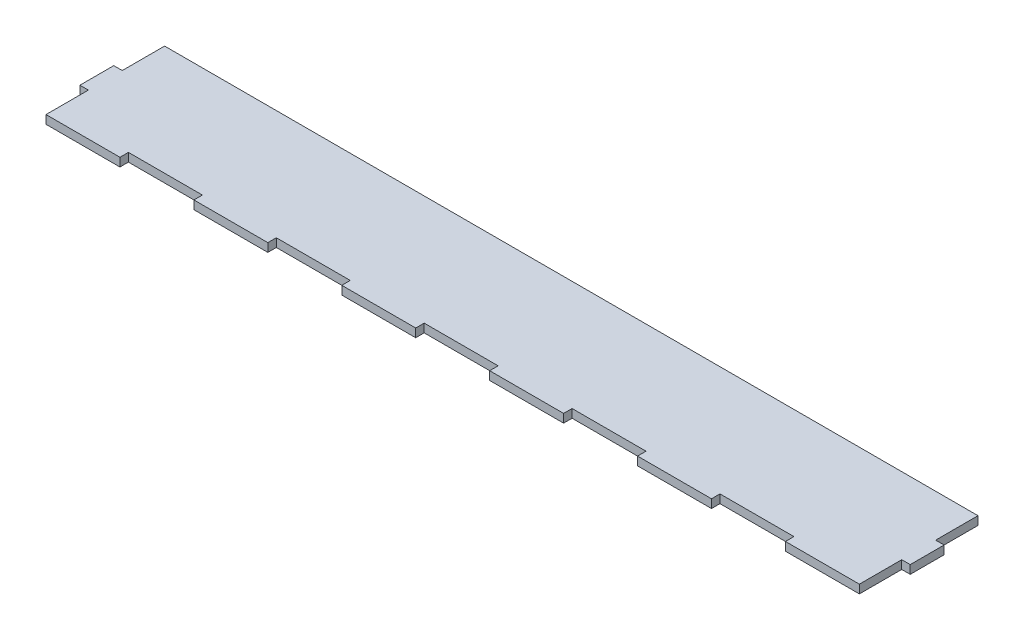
ISO-10303-21;
HEADER;
FILE_DESCRIPTION(('STEP AP214'),'2;1');
FILE_NAME('part.step','',(''),(''),'','','');
FILE_SCHEMA(('AUTOMOTIVE_DESIGN { 1 0 10303 214 1 1 1 1 }'));
ENDSEC;
DATA;
#1=APPLICATION_CONTEXT('core data for automotive mechanical design processes');
#2=APPLICATION_PROTOCOL_DEFINITION('international standard','automotive_design',2000,#1);
#3=PRODUCT_CONTEXT('',#1,'mechanical');
#4=PRODUCT('Part','Part','',(#3));
#5=PRODUCT_RELATED_PRODUCT_CATEGORY('part','',(#4));
#6=PRODUCT_DEFINITION_FORMATION('','',#4);
#7=PRODUCT_DEFINITION_CONTEXT('part definition',#1,'design');
#8=PRODUCT_DEFINITION('design','',#6,#7);
#9=PRODUCT_DEFINITION_SHAPE('','',#8);
#10=(LENGTH_UNIT() NAMED_UNIT(*) SI_UNIT(.MILLI.,.METRE.));
#11=(NAMED_UNIT(*) PLANE_ANGLE_UNIT() SI_UNIT($,.RADIAN.));
#12=(NAMED_UNIT(*) SI_UNIT($,.STERADIAN.) SOLID_ANGLE_UNIT());
#13=UNCERTAINTY_MEASURE_WITH_UNIT(LENGTH_MEASURE(1.E-05),#10,'distance_accuracy_value','');
#14=(GEOMETRIC_REPRESENTATION_CONTEXT(3) GLOBAL_UNCERTAINTY_ASSIGNED_CONTEXT((#13)) GLOBAL_UNIT_ASSIGNED_CONTEXT((#10,
#11,#12)) REPRESENTATION_CONTEXT('',''));
#15=CARTESIAN_POINT('',(0.,0.,0.));
#16=DIRECTION('',(0.,0.,1.));
#17=DIRECTION('',(1.,0.,0.));
#18=AXIS2_PLACEMENT_3D('',#15,#16,#17);
#19=CARTESIAN_POINT('',(152.4,3.175,-41.275));
#20=DIRECTION('',(0.,0.,1.));
#21=DIRECTION('',(1.,0.,0.));
#22=AXIS2_PLACEMENT_3D('',#19,#20,#21);
#23=PLANE('',#22);
#24=DIRECTION('',(-1.,0.,0.));
#25=VECTOR('',#24,1.);
#26=CARTESIAN_POINT('',(152.4,0.,-41.275));
#27=LINE('',#26,#25);
#28=CARTESIAN_POINT('',(152.4,0.,-41.275));
#29=VERTEX_POINT('',#28);
#30=CARTESIAN_POINT('',(-152.4,0.,-41.275));
#31=VERTEX_POINT('',#30);
#32=EDGE_CURVE('E521',#29,#31,#27,.T.);
#33=ORIENTED_EDGE('',*,*,#32,.T.);
#34=DIRECTION('',(0.,-1.,0.));
#35=VECTOR('',#34,1.);
#36=CARTESIAN_POINT('',(-152.4,3.175,-41.275));
#37=LINE('',#36,#35);
#38=CARTESIAN_POINT('',(-152.4,3.175,-41.275));
#39=VERTEX_POINT('',#38);
#40=EDGE_CURVE('E12',#39,#31,#37,.T.);
#41=ORIENTED_EDGE('',*,*,#40,.F.);
#42=DIRECTION('',(-1.,0.,0.));
#43=VECTOR('',#42,1.);
#44=CARTESIAN_POINT('',(152.4,3.175,-41.275));
#45=LINE('',#44,#43);
#46=CARTESIAN_POINT('',(152.4,3.175,-41.275));
#47=VERTEX_POINT('',#46);
#48=EDGE_CURVE('E414',#47,#39,#45,.T.);
#49=ORIENTED_EDGE('',*,*,#48,.F.);
#50=DIRECTION('',(0.,-1.,0.));
#51=VECTOR('',#50,1.);
#52=CARTESIAN_POINT('',(152.4,3.175,-41.275));
#53=LINE('',#52,#51);
#54=EDGE_CURVE('E275',#47,#29,#53,.T.);
#55=ORIENTED_EDGE('',*,*,#54,.T.);
#56=EDGE_LOOP('',(#33,#41,#49,#55));
#57=FACE_BOUND('',#56,.T.);
#58=ADVANCED_FACE('F36',(#57),#23,.F.);
#59=CARTESIAN_POINT('',(-152.4,3.175,-41.275));
#60=DIRECTION('',(1.,0.,0.));
#61=DIRECTION('',(0.,0.,-1.));
#62=AXIS2_PLACEMENT_3D('',#59,#60,#61);
#63=PLANE('',#62);
#64=DIRECTION('',(0.,0.,1.));
#65=VECTOR('',#64,1.);
#66=CARTESIAN_POINT('',(-152.4,0.,-41.275));
#67=LINE('',#66,#65);
#68=CARTESIAN_POINT('',(-152.4,0.,-25.4));
#69=VERTEX_POINT('',#68);
#70=EDGE_CURVE('E515',#31,#69,#67,.T.);
#71=ORIENTED_EDGE('',*,*,#70,.T.);
#72=DIRECTION('',(0.,-1.,0.));
#73=VECTOR('',#72,1.);
#74=CARTESIAN_POINT('',(-152.4,3.175,-25.4));
#75=LINE('',#74,#73);
#76=CARTESIAN_POINT('',(-152.4,3.175,-25.4));
#77=VERTEX_POINT('',#76);
#78=EDGE_CURVE('E44',#77,#69,#75,.T.);
#79=ORIENTED_EDGE('',*,*,#78,.F.);
#80=DIRECTION('',(0.,0.,1.));
#81=VECTOR('',#80,1.);
#82=CARTESIAN_POINT('',(-152.4,3.175,-41.275));
#83=LINE('',#82,#81);
#84=EDGE_CURVE('E167',#39,#77,#83,.T.);
#85=ORIENTED_EDGE('',*,*,#84,.F.);
#86=ORIENTED_EDGE('',*,*,#40,.T.);
#87=EDGE_LOOP('',(#71,#79,#85,#86));
#88=FACE_BOUND('',#87,.T.);
#89=ADVANCED_FACE('F590',(#88),#63,.F.);
#90=CARTESIAN_POINT('',(-152.4,3.175,-25.4));
#91=DIRECTION('',(0.,0.,1.));
#92=DIRECTION('',(1.,0.,0.));
#93=AXIS2_PLACEMENT_3D('',#90,#91,#92);
#94=PLANE('',#93);
#95=DIRECTION('',(-1.,0.,0.));
#96=VECTOR('',#95,1.);
#97=CARTESIAN_POINT('',(-152.4,0.,-25.4));
#98=LINE('',#97,#96);
#99=CARTESIAN_POINT('',(-155.575,0.,-25.4));
#100=VERTEX_POINT('',#99);
#101=EDGE_CURVE('E510',#69,#100,#98,.T.);
#102=ORIENTED_EDGE('',*,*,#101,.T.);
#103=DIRECTION('',(0.,-1.,0.));
#104=VECTOR('',#103,1.);
#105=CARTESIAN_POINT('',(-155.575,3.175,-25.4));
#106=LINE('',#105,#104);
#107=CARTESIAN_POINT('',(-155.575,3.175,-25.4));
#108=VERTEX_POINT('',#107);
#109=EDGE_CURVE('E502',#108,#100,#106,.T.);
#110=ORIENTED_EDGE('',*,*,#109,.F.);
#111=DIRECTION('',(-1.,0.,0.));
#112=VECTOR('',#111,1.);
#113=CARTESIAN_POINT('',(-152.4,3.175,-25.4));
#114=LINE('',#113,#112);
#115=EDGE_CURVE('E406',#77,#108,#114,.T.);
#116=ORIENTED_EDGE('',*,*,#115,.F.);
#117=ORIENTED_EDGE('',*,*,#78,.T.);
#118=EDGE_LOOP('',(#102,#110,#116,#117));
#119=FACE_BOUND('',#118,.T.);
#120=ADVANCED_FACE('F508',(#119),#94,.F.);
#121=CARTESIAN_POINT('',(-155.575,3.175,-25.4));
#122=DIRECTION('',(1.,0.,0.));
#123=DIRECTION('',(0.,0.,-1.));
#124=AXIS2_PLACEMENT_3D('',#121,#122,#123);
#125=PLANE('',#124);
#126=DIRECTION('',(0.,0.,1.));
#127=VECTOR('',#126,1.);
#128=CARTESIAN_POINT('',(-155.575,0.,-25.4));
#129=LINE('',#128,#127);
#130=CARTESIAN_POINT('',(-155.575,0.,-12.7));
#131=VERTEX_POINT('',#130);
#132=EDGE_CURVE('E517',#100,#131,#129,.T.);
#133=ORIENTED_EDGE('',*,*,#132,.T.);
#134=DIRECTION('',(0.,-1.,0.));
#135=VECTOR('',#134,1.);
#136=CARTESIAN_POINT('',(-155.575,3.175,-12.7));
#137=LINE('',#136,#135);
#138=CARTESIAN_POINT('',(-155.575,3.175,-12.7));
#139=VERTEX_POINT('',#138);
#140=EDGE_CURVE('E499',#139,#131,#137,.T.);
#141=ORIENTED_EDGE('',*,*,#140,.F.);
#142=DIRECTION('',(0.,0.,1.));
#143=VECTOR('',#142,1.);
#144=CARTESIAN_POINT('',(-155.575,3.175,-25.4));
#145=LINE('',#144,#143);
#146=EDGE_CURVE('E402',#108,#139,#145,.T.);
#147=ORIENTED_EDGE('',*,*,#146,.F.);
#148=ORIENTED_EDGE('',*,*,#109,.T.);
#149=EDGE_LOOP('',(#133,#141,#147,#148));
#150=FACE_BOUND('',#149,.T.);
#151=ADVANCED_FACE('F597',(#150),#125,.F.);
#152=CARTESIAN_POINT('',(-155.575,3.175,-12.7));
#153=DIRECTION('',(0.,0.,-1.));
#154=DIRECTION('',(-1.,0.,0.));
#155=AXIS2_PLACEMENT_3D('',#152,#153,#154);
#156=PLANE('',#155);
#157=DIRECTION('',(1.,0.,0.));
#158=VECTOR('',#157,1.);
#159=CARTESIAN_POINT('',(-155.575,0.,-12.7));
#160=LINE('',#159,#158);
#161=CARTESIAN_POINT('',(-152.4,0.,-12.7));
#162=VERTEX_POINT('',#161);
#163=EDGE_CURVE('E519',#131,#162,#160,.T.);
#164=ORIENTED_EDGE('',*,*,#163,.T.);
#165=DIRECTION('',(0.,-1.,0.));
#166=VECTOR('',#165,1.);
#167=CARTESIAN_POINT('',(-152.4,3.175,-12.7));
#168=LINE('',#167,#166);
#169=CARTESIAN_POINT('',(-152.4,3.175,-12.7));
#170=VERTEX_POINT('',#169);
#171=EDGE_CURVE('E496',#170,#162,#168,.T.);
#172=ORIENTED_EDGE('',*,*,#171,.F.);
#173=DIRECTION('',(1.,0.,0.));
#174=VECTOR('',#173,1.);
#175=CARTESIAN_POINT('',(-155.575,3.175,-12.7));
#176=LINE('',#175,#174);
#177=EDGE_CURVE('E399',#139,#170,#176,.T.);
#178=ORIENTED_EDGE('',*,*,#177,.F.);
#179=ORIENTED_EDGE('',*,*,#140,.T.);
#180=EDGE_LOOP('',(#164,#172,#178,#179));
#181=FACE_BOUND('',#180,.T.);
#182=ADVANCED_FACE('F602',(#181),#156,.F.);
#183=CARTESIAN_POINT('',(-152.4,3.175,-12.7));
#184=DIRECTION('',(1.,0.,0.));
#185=DIRECTION('',(0.,0.,-1.));
#186=AXIS2_PLACEMENT_3D('',#183,#184,#185);
#187=PLANE('',#186);
#188=DIRECTION('',(0.,0.,1.));
#189=VECTOR('',#188,1.);
#190=CARTESIAN_POINT('',(-152.4,0.,-12.7));
#191=LINE('',#190,#189);
#192=CARTESIAN_POINT('',(-152.4,0.,3.175));
#193=VERTEX_POINT('',#192);
#194=EDGE_CURVE('E525',#162,#193,#191,.T.);
#195=ORIENTED_EDGE('',*,*,#194,.T.);
#196=DIRECTION('',(0.,-1.,0.));
#197=VECTOR('',#196,1.);
#198=CARTESIAN_POINT('',(-152.4,3.175,3.175));
#199=LINE('',#198,#197);
#200=CARTESIAN_POINT('',(-152.4,3.175,3.175));
#201=VERTEX_POINT('',#200);
#202=EDGE_CURVE('E493',#201,#193,#199,.T.);
#203=ORIENTED_EDGE('',*,*,#202,.F.);
#204=DIRECTION('',(0.,0.,1.));
#205=VECTOR('',#204,1.);
#206=CARTESIAN_POINT('',(-152.4,3.175,-12.7));
#207=LINE('',#206,#205);
#208=EDGE_CURVE('E391',#170,#201,#207,.T.);
#209=ORIENTED_EDGE('',*,*,#208,.F.);
#210=ORIENTED_EDGE('',*,*,#171,.T.);
#211=EDGE_LOOP('',(#195,#203,#209,#210));
#212=FACE_BOUND('',#211,.T.);
#213=ADVANCED_FACE('F606',(#212),#187,.F.);
#214=CARTESIAN_POINT('',(-152.4,3.175,3.175));
#215=DIRECTION('',(0.,0.,-1.));
#216=DIRECTION('',(-1.,0.,0.));
#217=AXIS2_PLACEMENT_3D('',#214,#215,#216);
#218=PLANE('',#217);
#219=DIRECTION('',(1.,0.,0.));
#220=VECTOR('',#219,1.);
#221=CARTESIAN_POINT('',(-152.4,0.,3.175));
#222=LINE('',#221,#220);
#223=CARTESIAN_POINT('',(-124.690909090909,0.,3.175));
#224=VERTEX_POINT('',#223);
#225=EDGE_CURVE('E527',#193,#224,#222,.T.);
#226=ORIENTED_EDGE('',*,*,#225,.T.);
#227=DIRECTION('',(0.,-1.,0.));
#228=VECTOR('',#227,1.);
#229=CARTESIAN_POINT('',(-124.690909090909,3.175,3.175));
#230=LINE('',#229,#228);
#231=CARTESIAN_POINT('',(-124.690909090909,3.175,3.175));
#232=VERTEX_POINT('',#231);
#233=EDGE_CURVE('E490',#232,#224,#230,.T.);
#234=ORIENTED_EDGE('',*,*,#233,.F.);
#235=DIRECTION('',(1.,0.,0.));
#236=VECTOR('',#235,1.);
#237=CARTESIAN_POINT('',(-152.4,3.175,3.175));
#238=LINE('',#237,#236);
#239=EDGE_CURVE('E387',#201,#232,#238,.T.);
#240=ORIENTED_EDGE('',*,*,#239,.F.);
#241=ORIENTED_EDGE('',*,*,#202,.T.);
#242=EDGE_LOOP('',(#226,#234,#240,#241));
#243=FACE_BOUND('',#242,.T.);
#244=ADVANCED_FACE('F610',(#243),#218,.F.);
#245=CARTESIAN_POINT('',(-124.690909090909,3.175,3.175));
#246=DIRECTION('',(-1.,0.,0.));
#247=DIRECTION('',(0.,0.,1.));
#248=AXIS2_PLACEMENT_3D('',#245,#246,#247);
#249=PLANE('',#248);
#250=DIRECTION('',(0.,0.,-1.));
#251=VECTOR('',#250,1.);
#252=CARTESIAN_POINT('',(-124.690909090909,0.,3.175));
#253=LINE('',#252,#251);
#254=CARTESIAN_POINT('',(-124.690909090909,0.,0.));
#255=VERTEX_POINT('',#254);
#256=EDGE_CURVE('E529',#224,#255,#253,.T.);
#257=ORIENTED_EDGE('',*,*,#256,.T.);
#258=DIRECTION('',(0.,-1.,0.));
#259=VECTOR('',#258,1.);
#260=CARTESIAN_POINT('',(-124.690909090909,3.175,0.));
#261=LINE('',#260,#259);
#262=CARTESIAN_POINT('',(-124.690909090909,3.175,0.));
#263=VERTEX_POINT('',#262);
#264=EDGE_CURVE('E487',#263,#255,#261,.T.);
#265=ORIENTED_EDGE('',*,*,#264,.F.);
#266=DIRECTION('',(0.,0.,-1.));
#267=VECTOR('',#266,1.);
#268=CARTESIAN_POINT('',(-124.690909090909,3.175,3.175));
#269=LINE('',#268,#267);
#270=EDGE_CURVE('E383',#232,#263,#269,.T.);
#271=ORIENTED_EDGE('',*,*,#270,.F.);
#272=ORIENTED_EDGE('',*,*,#233,.T.);
#273=EDGE_LOOP('',(#257,#265,#271,#272));
#274=FACE_BOUND('',#273,.T.);
#275=ADVANCED_FACE('F614',(#274),#249,.F.);
#276=CARTESIAN_POINT('',(-124.690909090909,3.175,0.));
#277=DIRECTION('',(0.,0.,-1.));
#278=DIRECTION('',(-1.,0.,0.));
#279=AXIS2_PLACEMENT_3D('',#276,#277,#278);
#280=PLANE('',#279);
#281=DIRECTION('',(1.,0.,0.));
#282=VECTOR('',#281,1.);
#283=CARTESIAN_POINT('',(-124.690909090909,0.,0.));
#284=LINE('',#283,#282);
#285=CARTESIAN_POINT('',(-96.9818181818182,0.,0.));
#286=VERTEX_POINT('',#285);
#287=EDGE_CURVE('E531',#255,#286,#284,.T.);
#288=ORIENTED_EDGE('',*,*,#287,.T.);
#289=DIRECTION('',(0.,-1.,0.));
#290=VECTOR('',#289,1.);
#291=CARTESIAN_POINT('',(-96.9818181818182,3.175,0.));
#292=LINE('',#291,#290);
#293=CARTESIAN_POINT('',(-96.9818181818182,3.175,0.));
#294=VERTEX_POINT('',#293);
#295=EDGE_CURVE('E484',#294,#286,#292,.T.);
#296=ORIENTED_EDGE('',*,*,#295,.F.);
#297=DIRECTION('',(1.,0.,0.));
#298=VECTOR('',#297,1.);
#299=CARTESIAN_POINT('',(-124.690909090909,3.175,0.));
#300=LINE('',#299,#298);
#301=EDGE_CURVE('E380',#263,#294,#300,.T.);
#302=ORIENTED_EDGE('',*,*,#301,.F.);
#303=ORIENTED_EDGE('',*,*,#264,.T.);
#304=EDGE_LOOP('',(#288,#296,#302,#303));
#305=FACE_BOUND('',#304,.T.);
#306=ADVANCED_FACE('F618',(#305),#280,.F.);
#307=CARTESIAN_POINT('',(-96.9818181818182,3.175,0.));
#308=DIRECTION('',(1.,0.,0.));
#309=DIRECTION('',(0.,0.,-1.));
#310=AXIS2_PLACEMENT_3D('',#307,#308,#309);
#311=PLANE('',#310);
#312=DIRECTION('',(0.,0.,1.));
#313=VECTOR('',#312,1.);
#314=CARTESIAN_POINT('',(-96.9818181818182,0.,0.));
#315=LINE('',#314,#313);
#316=CARTESIAN_POINT('',(-96.9818181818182,0.,3.17499999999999));
#317=VERTEX_POINT('',#316);
#318=EDGE_CURVE('E533',#286,#317,#315,.T.);
#319=ORIENTED_EDGE('',*,*,#318,.T.);
#320=DIRECTION('',(0.,-1.,0.));
#321=VECTOR('',#320,1.);
#322=CARTESIAN_POINT('',(-96.9818181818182,3.175,3.17499999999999));
#323=LINE('',#322,#321);
#324=CARTESIAN_POINT('',(-96.9818181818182,3.175,3.17499999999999));
#325=VERTEX_POINT('',#324);
#326=EDGE_CURVE('E481',#325,#317,#323,.T.);
#327=ORIENTED_EDGE('',*,*,#326,.F.);
#328=DIRECTION('',(0.,0.,1.));
#329=VECTOR('',#328,1.);
#330=CARTESIAN_POINT('',(-96.9818181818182,3.175,0.));
#331=LINE('',#330,#329);
#332=EDGE_CURVE('E372',#294,#325,#331,.T.);
#333=ORIENTED_EDGE('',*,*,#332,.F.);
#334=ORIENTED_EDGE('',*,*,#295,.T.);
#335=EDGE_LOOP('',(#319,#327,#333,#334));
#336=FACE_BOUND('',#335,.T.);
#337=ADVANCED_FACE('F622',(#336),#311,.F.);
#338=CARTESIAN_POINT('',(-96.9818181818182,3.175,3.17499999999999));
#339=DIRECTION('',(0.,0.,-1.));
#340=DIRECTION('',(-1.,0.,0.));
#341=AXIS2_PLACEMENT_3D('',#338,#339,#340);
#342=PLANE('',#341);
#343=DIRECTION('',(1.,0.,0.));
#344=VECTOR('',#343,1.);
#345=CARTESIAN_POINT('',(-96.9818181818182,0.,3.17499999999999));
#346=LINE('',#345,#344);
#347=CARTESIAN_POINT('',(-69.2727272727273,0.,3.17499999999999));
#348=VERTEX_POINT('',#347);
#349=EDGE_CURVE('E535',#317,#348,#346,.T.);
#350=ORIENTED_EDGE('',*,*,#349,.T.);
#351=DIRECTION('',(0.,-1.,0.));
#352=VECTOR('',#351,1.);
#353=CARTESIAN_POINT('',(-69.2727272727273,3.175,3.17499999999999));
#354=LINE('',#353,#352);
#355=CARTESIAN_POINT('',(-69.2727272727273,3.175,3.17499999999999));
#356=VERTEX_POINT('',#355);
#357=EDGE_CURVE('E478',#356,#348,#354,.T.);
#358=ORIENTED_EDGE('',*,*,#357,.F.);
#359=DIRECTION('',(1.,0.,0.));
#360=VECTOR('',#359,1.);
#361=CARTESIAN_POINT('',(-96.9818181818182,3.175,3.17499999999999));
#362=LINE('',#361,#360);
#363=EDGE_CURVE('E368',#325,#356,#362,.T.);
#364=ORIENTED_EDGE('',*,*,#363,.F.);
#365=ORIENTED_EDGE('',*,*,#326,.T.);
#366=EDGE_LOOP('',(#350,#358,#364,#365));
#367=FACE_BOUND('',#366,.T.);
#368=ADVANCED_FACE('F626',(#367),#342,.F.);
#369=CARTESIAN_POINT('',(-69.2727272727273,3.175,3.17499999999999));
#370=DIRECTION('',(-1.,0.,0.));
#371=DIRECTION('',(0.,0.,1.));
#372=AXIS2_PLACEMENT_3D('',#369,#370,#371);
#373=PLANE('',#372);
#374=DIRECTION('',(0.,0.,-1.));
#375=VECTOR('',#374,1.);
#376=CARTESIAN_POINT('',(-69.2727272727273,0.,3.17499999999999));
#377=LINE('',#376,#375);
#378=CARTESIAN_POINT('',(-69.2727272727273,0.,0.));
#379=VERTEX_POINT('',#378);
#380=EDGE_CURVE('E537',#348,#379,#377,.T.);
#381=ORIENTED_EDGE('',*,*,#380,.T.);
#382=DIRECTION('',(0.,-1.,0.));
#383=VECTOR('',#382,1.);
#384=CARTESIAN_POINT('',(-69.2727272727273,3.175,0.));
#385=LINE('',#384,#383);
#386=CARTESIAN_POINT('',(-69.2727272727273,3.175,0.));
#387=VERTEX_POINT('',#386);
#388=EDGE_CURVE('E475',#387,#379,#385,.T.);
#389=ORIENTED_EDGE('',*,*,#388,.F.);
#390=DIRECTION('',(0.,0.,-1.));
#391=VECTOR('',#390,1.);
#392=CARTESIAN_POINT('',(-69.2727272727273,3.175,3.17499999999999));
#393=LINE('',#392,#391);
#394=EDGE_CURVE('E364',#356,#387,#393,.T.);
#395=ORIENTED_EDGE('',*,*,#394,.F.);
#396=ORIENTED_EDGE('',*,*,#357,.T.);
#397=EDGE_LOOP('',(#381,#389,#395,#396));
#398=FACE_BOUND('',#397,.T.);
#399=ADVANCED_FACE('F630',(#398),#373,.F.);
#400=CARTESIAN_POINT('',(-69.2727272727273,3.175,0.));
#401=DIRECTION('',(0.,0.,-1.));
#402=DIRECTION('',(-1.,0.,0.));
#403=AXIS2_PLACEMENT_3D('',#400,#401,#402);
#404=PLANE('',#403);
#405=DIRECTION('',(1.,0.,0.));
#406=VECTOR('',#405,1.);
#407=CARTESIAN_POINT('',(-69.2727272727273,0.,0.));
#408=LINE('',#407,#406);
#409=CARTESIAN_POINT('',(-41.5636363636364,0.,0.));
#410=VERTEX_POINT('',#409);
#411=EDGE_CURVE('E539',#379,#410,#408,.T.);
#412=ORIENTED_EDGE('',*,*,#411,.T.);
#413=DIRECTION('',(0.,-1.,0.));
#414=VECTOR('',#413,1.);
#415=CARTESIAN_POINT('',(-41.5636363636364,3.175,0.));
#416=LINE('',#415,#414);
#417=CARTESIAN_POINT('',(-41.5636363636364,3.175,0.));
#418=VERTEX_POINT('',#417);
#419=EDGE_CURVE('E472',#418,#410,#416,.T.);
#420=ORIENTED_EDGE('',*,*,#419,.F.);
#421=DIRECTION('',(1.,0.,0.));
#422=VECTOR('',#421,1.);
#423=CARTESIAN_POINT('',(-69.2727272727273,3.175,0.));
#424=LINE('',#423,#422);
#425=EDGE_CURVE('E361',#387,#418,#424,.T.);
#426=ORIENTED_EDGE('',*,*,#425,.F.);
#427=ORIENTED_EDGE('',*,*,#388,.T.);
#428=EDGE_LOOP('',(#412,#420,#426,#427));
#429=FACE_BOUND('',#428,.T.);
#430=ADVANCED_FACE('F634',(#429),#404,.F.);
#431=CARTESIAN_POINT('',(-41.5636363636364,3.175,0.));
#432=DIRECTION('',(1.,0.,0.));
#433=DIRECTION('',(0.,0.,-1.));
#434=AXIS2_PLACEMENT_3D('',#431,#432,#433);
#435=PLANE('',#434);
#436=DIRECTION('',(0.,0.,1.));
#437=VECTOR('',#436,1.);
#438=CARTESIAN_POINT('',(-41.5636363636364,0.,0.));
#439=LINE('',#438,#437);
#440=CARTESIAN_POINT('',(-41.5636363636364,0.,3.17499999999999));
#441=VERTEX_POINT('',#440);
#442=EDGE_CURVE('E541',#410,#441,#439,.T.);
#443=ORIENTED_EDGE('',*,*,#442,.T.);
#444=DIRECTION('',(0.,-1.,0.));
#445=VECTOR('',#444,1.);
#446=CARTESIAN_POINT('',(-41.5636363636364,3.175,3.17499999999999));
#447=LINE('',#446,#445);
#448=CARTESIAN_POINT('',(-41.5636363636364,3.175,3.17499999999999));
#449=VERTEX_POINT('',#448);
#450=EDGE_CURVE('E469',#449,#441,#447,.T.);
#451=ORIENTED_EDGE('',*,*,#450,.F.);
#452=DIRECTION('',(0.,0.,1.));
#453=VECTOR('',#452,1.);
#454=CARTESIAN_POINT('',(-41.5636363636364,3.175,0.));
#455=LINE('',#454,#453);
#456=EDGE_CURVE('E353',#418,#449,#455,.T.);
#457=ORIENTED_EDGE('',*,*,#456,.F.);
#458=ORIENTED_EDGE('',*,*,#419,.T.);
#459=EDGE_LOOP('',(#443,#451,#457,#458));
#460=FACE_BOUND('',#459,.T.);
#461=ADVANCED_FACE('F638',(#460),#435,.F.);
#462=CARTESIAN_POINT('',(-41.5636363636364,3.175,3.17499999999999));
#463=DIRECTION('',(0.,0.,-1.));
#464=DIRECTION('',(-1.,0.,0.));
#465=AXIS2_PLACEMENT_3D('',#462,#463,#464);
#466=PLANE('',#465);
#467=DIRECTION('',(1.,0.,0.));
#468=VECTOR('',#467,1.);
#469=CARTESIAN_POINT('',(-41.5636363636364,0.,3.17499999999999));
#470=LINE('',#469,#468);
#471=CARTESIAN_POINT('',(-13.8545454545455,0.,3.17499999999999));
#472=VERTEX_POINT('',#471);
#473=EDGE_CURVE('E543',#441,#472,#470,.T.);
#474=ORIENTED_EDGE('',*,*,#473,.T.);
#475=DIRECTION('',(0.,-1.,0.));
#476=VECTOR('',#475,1.);
#477=CARTESIAN_POINT('',(-13.8545454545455,3.175,3.17499999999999));
#478=LINE('',#477,#476);
#479=CARTESIAN_POINT('',(-13.8545454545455,3.175,3.17499999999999));
#480=VERTEX_POINT('',#479);
#481=EDGE_CURVE('E466',#480,#472,#478,.T.);
#482=ORIENTED_EDGE('',*,*,#481,.F.);
#483=DIRECTION('',(1.,0.,0.));
#484=VECTOR('',#483,1.);
#485=CARTESIAN_POINT('',(-41.5636363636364,3.175,3.17499999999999));
#486=LINE('',#485,#484);
#487=EDGE_CURVE('E349',#449,#480,#486,.T.);
#488=ORIENTED_EDGE('',*,*,#487,.F.);
#489=ORIENTED_EDGE('',*,*,#450,.T.);
#490=EDGE_LOOP('',(#474,#482,#488,#489));
#491=FACE_BOUND('',#490,.T.);
#492=ADVANCED_FACE('F642',(#491),#466,.F.);
#493=CARTESIAN_POINT('',(-13.8545454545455,3.175,3.17499999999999));
#494=DIRECTION('',(-1.,0.,0.));
#495=DIRECTION('',(0.,0.,1.));
#496=AXIS2_PLACEMENT_3D('',#493,#494,#495);
#497=PLANE('',#496);
#498=DIRECTION('',(0.,0.,-1.));
#499=VECTOR('',#498,1.);
#500=CARTESIAN_POINT('',(-13.8545454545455,0.,3.17499999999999));
#501=LINE('',#500,#499);
#502=CARTESIAN_POINT('',(-13.8545454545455,0.,0.));
#503=VERTEX_POINT('',#502);
#504=EDGE_CURVE('E545',#472,#503,#501,.T.);
#505=ORIENTED_EDGE('',*,*,#504,.T.);
#506=DIRECTION('',(0.,-1.,0.));
#507=VECTOR('',#506,1.);
#508=CARTESIAN_POINT('',(-13.8545454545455,3.175,0.));
#509=LINE('',#508,#507);
#510=CARTESIAN_POINT('',(-13.8545454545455,3.175,0.));
#511=VERTEX_POINT('',#510);
#512=EDGE_CURVE('E463',#511,#503,#509,.T.);
#513=ORIENTED_EDGE('',*,*,#512,.F.);
#514=DIRECTION('',(0.,0.,-1.));
#515=VECTOR('',#514,1.);
#516=CARTESIAN_POINT('',(-13.8545454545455,3.175,3.17499999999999));
#517=LINE('',#516,#515);
#518=EDGE_CURVE('E345',#480,#511,#517,.T.);
#519=ORIENTED_EDGE('',*,*,#518,.F.);
#520=ORIENTED_EDGE('',*,*,#481,.T.);
#521=EDGE_LOOP('',(#505,#513,#519,#520));
#522=FACE_BOUND('',#521,.T.);
#523=ADVANCED_FACE('F646',(#522),#497,.F.);
#524=CARTESIAN_POINT('',(-13.8545454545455,3.175,0.));
#525=DIRECTION('',(0.,0.,-1.));
#526=DIRECTION('',(-1.,0.,0.));
#527=AXIS2_PLACEMENT_3D('',#524,#525,#526);
#528=PLANE('',#527);
#529=DIRECTION('',(1.,0.,0.));
#530=VECTOR('',#529,1.);
#531=CARTESIAN_POINT('',(-13.8545454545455,0.,0.));
#532=LINE('',#531,#530);
#533=CARTESIAN_POINT('',(13.8545454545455,0.,0.));
#534=VERTEX_POINT('',#533);
#535=EDGE_CURVE('E547',#503,#534,#532,.T.);
#536=ORIENTED_EDGE('',*,*,#535,.T.);
#537=DIRECTION('',(0.,-1.,0.));
#538=VECTOR('',#537,1.);
#539=CARTESIAN_POINT('',(13.8545454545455,3.175,0.));
#540=LINE('',#539,#538);
#541=CARTESIAN_POINT('',(13.8545454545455,3.175,0.));
#542=VERTEX_POINT('',#541);
#543=EDGE_CURVE('E460',#542,#534,#540,.T.);
#544=ORIENTED_EDGE('',*,*,#543,.F.);
#545=DIRECTION('',(1.,0.,0.));
#546=VECTOR('',#545,1.);
#547=CARTESIAN_POINT('',(-13.8545454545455,3.175,0.));
#548=LINE('',#547,#546);
#549=EDGE_CURVE('E342',#511,#542,#548,.T.);
#550=ORIENTED_EDGE('',*,*,#549,.F.);
#551=ORIENTED_EDGE('',*,*,#512,.T.);
#552=EDGE_LOOP('',(#536,#544,#550,#551));
#553=FACE_BOUND('',#552,.T.);
#554=ADVANCED_FACE('F650',(#553),#528,.F.);
#555=CARTESIAN_POINT('',(13.8545454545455,3.175,0.));
#556=DIRECTION('',(1.,0.,0.));
#557=DIRECTION('',(0.,0.,-1.));
#558=AXIS2_PLACEMENT_3D('',#555,#556,#557);
#559=PLANE('',#558);
#560=DIRECTION('',(0.,0.,1.));
#561=VECTOR('',#560,1.);
#562=CARTESIAN_POINT('',(13.8545454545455,0.,0.));
#563=LINE('',#562,#561);
#564=CARTESIAN_POINT('',(13.8545454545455,0.,3.17499999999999));
#565=VERTEX_POINT('',#564);
#566=EDGE_CURVE('E549',#534,#565,#563,.T.);
#567=ORIENTED_EDGE('',*,*,#566,.T.);
#568=DIRECTION('',(0.,-1.,0.));
#569=VECTOR('',#568,1.);
#570=CARTESIAN_POINT('',(13.8545454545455,3.175,3.17499999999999));
#571=LINE('',#570,#569);
#572=CARTESIAN_POINT('',(13.8545454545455,3.175,3.17499999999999));
#573=VERTEX_POINT('',#572);
#574=EDGE_CURVE('E457',#573,#565,#571,.T.);
#575=ORIENTED_EDGE('',*,*,#574,.F.);
#576=DIRECTION('',(0.,0.,1.));
#577=VECTOR('',#576,1.);
#578=CARTESIAN_POINT('',(13.8545454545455,3.175,0.));
#579=LINE('',#578,#577);
#580=EDGE_CURVE('E334',#542,#573,#579,.T.);
#581=ORIENTED_EDGE('',*,*,#580,.F.);
#582=ORIENTED_EDGE('',*,*,#543,.T.);
#583=EDGE_LOOP('',(#567,#575,#581,#582));
#584=FACE_BOUND('',#583,.T.);
#585=ADVANCED_FACE('F654',(#584),#559,.F.);
#586=CARTESIAN_POINT('',(13.8545454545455,3.175,3.17499999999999));
#587=DIRECTION('',(0.,0.,-1.));
#588=DIRECTION('',(-1.,0.,0.));
#589=AXIS2_PLACEMENT_3D('',#586,#587,#588);
#590=PLANE('',#589);
#591=DIRECTION('',(1.,0.,0.));
#592=VECTOR('',#591,1.);
#593=CARTESIAN_POINT('',(13.8545454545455,0.,3.17499999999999));
#594=LINE('',#593,#592);
#595=CARTESIAN_POINT('',(41.5636363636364,0.,3.17499999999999));
#596=VERTEX_POINT('',#595);
#597=EDGE_CURVE('E551',#565,#596,#594,.T.);
#598=ORIENTED_EDGE('',*,*,#597,.T.);
#599=DIRECTION('',(0.,-1.,0.));
#600=VECTOR('',#599,1.);
#601=CARTESIAN_POINT('',(41.5636363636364,3.175,3.17499999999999));
#602=LINE('',#601,#600);
#603=CARTESIAN_POINT('',(41.5636363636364,3.175,3.17499999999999));
#604=VERTEX_POINT('',#603);
#605=EDGE_CURVE('E454',#604,#596,#602,.T.);
#606=ORIENTED_EDGE('',*,*,#605,.F.);
#607=DIRECTION('',(1.,0.,0.));
#608=VECTOR('',#607,1.);
#609=CARTESIAN_POINT('',(13.8545454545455,3.175,3.17499999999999));
#610=LINE('',#609,#608);
#611=EDGE_CURVE('E330',#573,#604,#610,.T.);
#612=ORIENTED_EDGE('',*,*,#611,.F.);
#613=ORIENTED_EDGE('',*,*,#574,.T.);
#614=EDGE_LOOP('',(#598,#606,#612,#613));
#615=FACE_BOUND('',#614,.T.);
#616=ADVANCED_FACE('F658',(#615),#590,.F.);
#617=CARTESIAN_POINT('',(41.5636363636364,3.175,3.17499999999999));
#618=DIRECTION('',(-1.,0.,0.));
#619=DIRECTION('',(0.,0.,1.));
#620=AXIS2_PLACEMENT_3D('',#617,#618,#619);
#621=PLANE('',#620);
#622=DIRECTION('',(0.,0.,-1.));
#623=VECTOR('',#622,1.);
#624=CARTESIAN_POINT('',(41.5636363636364,0.,3.17499999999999));
#625=LINE('',#624,#623);
#626=CARTESIAN_POINT('',(41.5636363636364,0.,0.));
#627=VERTEX_POINT('',#626);
#628=EDGE_CURVE('E553',#596,#627,#625,.T.);
#629=ORIENTED_EDGE('',*,*,#628,.T.);
#630=DIRECTION('',(0.,-1.,0.));
#631=VECTOR('',#630,1.);
#632=CARTESIAN_POINT('',(41.5636363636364,3.175,0.));
#633=LINE('',#632,#631);
#634=CARTESIAN_POINT('',(41.5636363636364,3.175,0.));
#635=VERTEX_POINT('',#634);
#636=EDGE_CURVE('E451',#635,#627,#633,.T.);
#637=ORIENTED_EDGE('',*,*,#636,.F.);
#638=DIRECTION('',(0.,0.,-1.));
#639=VECTOR('',#638,1.);
#640=CARTESIAN_POINT('',(41.5636363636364,3.175,3.17499999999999));
#641=LINE('',#640,#639);
#642=EDGE_CURVE('E326',#604,#635,#641,.T.);
#643=ORIENTED_EDGE('',*,*,#642,.F.);
#644=ORIENTED_EDGE('',*,*,#605,.T.);
#645=EDGE_LOOP('',(#629,#637,#643,#644));
#646=FACE_BOUND('',#645,.T.);
#647=ADVANCED_FACE('F662',(#646),#621,.F.);
#648=CARTESIAN_POINT('',(41.5636363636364,3.175,0.));
#649=DIRECTION('',(0.,0.,-1.));
#650=DIRECTION('',(-1.,0.,0.));
#651=AXIS2_PLACEMENT_3D('',#648,#649,#650);
#652=PLANE('',#651);
#653=DIRECTION('',(1.,0.,0.));
#654=VECTOR('',#653,1.);
#655=CARTESIAN_POINT('',(41.5636363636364,0.,0.));
#656=LINE('',#655,#654);
#657=CARTESIAN_POINT('',(69.2727272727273,0.,0.));
#658=VERTEX_POINT('',#657);
#659=EDGE_CURVE('E555',#627,#658,#656,.T.);
#660=ORIENTED_EDGE('',*,*,#659,.T.);
#661=DIRECTION('',(0.,-1.,0.));
#662=VECTOR('',#661,1.);
#663=CARTESIAN_POINT('',(69.2727272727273,3.175,0.));
#664=LINE('',#663,#662);
#665=CARTESIAN_POINT('',(69.2727272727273,3.175,0.));
#666=VERTEX_POINT('',#665);
#667=EDGE_CURVE('E448',#666,#658,#664,.T.);
#668=ORIENTED_EDGE('',*,*,#667,.F.);
#669=DIRECTION('',(1.,0.,0.));
#670=VECTOR('',#669,1.);
#671=CARTESIAN_POINT('',(41.5636363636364,3.175,0.));
#672=LINE('',#671,#670);
#673=EDGE_CURVE('E323',#635,#666,#672,.T.);
#674=ORIENTED_EDGE('',*,*,#673,.F.);
#675=ORIENTED_EDGE('',*,*,#636,.T.);
#676=EDGE_LOOP('',(#660,#668,#674,#675));
#677=FACE_BOUND('',#676,.T.);
#678=ADVANCED_FACE('F666',(#677),#652,.F.);
#679=CARTESIAN_POINT('',(69.2727272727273,3.175,0.));
#680=DIRECTION('',(1.,0.,0.));
#681=DIRECTION('',(0.,0.,-1.));
#682=AXIS2_PLACEMENT_3D('',#679,#680,#681);
#683=PLANE('',#682);
#684=DIRECTION('',(0.,0.,1.));
#685=VECTOR('',#684,1.);
#686=CARTESIAN_POINT('',(69.2727272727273,0.,0.));
#687=LINE('',#686,#685);
#688=CARTESIAN_POINT('',(69.2727272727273,0.,3.17499999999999));
#689=VERTEX_POINT('',#688);
#690=EDGE_CURVE('E557',#658,#689,#687,.T.);
#691=ORIENTED_EDGE('',*,*,#690,.T.);
#692=DIRECTION('',(0.,-1.,0.));
#693=VECTOR('',#692,1.);
#694=CARTESIAN_POINT('',(69.2727272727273,3.175,3.17499999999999));
#695=LINE('',#694,#693);
#696=CARTESIAN_POINT('',(69.2727272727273,3.175,3.17499999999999));
#697=VERTEX_POINT('',#696);
#698=EDGE_CURVE('E445',#697,#689,#695,.T.);
#699=ORIENTED_EDGE('',*,*,#698,.F.);
#700=DIRECTION('',(0.,0.,1.));
#701=VECTOR('',#700,1.);
#702=CARTESIAN_POINT('',(69.2727272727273,3.175,0.));
#703=LINE('',#702,#701);
#704=EDGE_CURVE('E315',#666,#697,#703,.T.);
#705=ORIENTED_EDGE('',*,*,#704,.F.);
#706=ORIENTED_EDGE('',*,*,#667,.T.);
#707=EDGE_LOOP('',(#691,#699,#705,#706));
#708=FACE_BOUND('',#707,.T.);
#709=ADVANCED_FACE('F670',(#708),#683,.F.);
#710=CARTESIAN_POINT('',(69.2727272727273,3.175,3.17499999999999));
#711=DIRECTION('',(0.,0.,-1.));
#712=DIRECTION('',(-1.,0.,0.));
#713=AXIS2_PLACEMENT_3D('',#710,#711,#712);
#714=PLANE('',#713);
#715=DIRECTION('',(1.,0.,0.));
#716=VECTOR('',#715,1.);
#717=CARTESIAN_POINT('',(69.2727272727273,0.,3.17499999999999));
#718=LINE('',#717,#716);
#719=CARTESIAN_POINT('',(96.9818181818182,0.,3.17499999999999));
#720=VERTEX_POINT('',#719);
#721=EDGE_CURVE('E559',#689,#720,#718,.T.);
#722=ORIENTED_EDGE('',*,*,#721,.T.);
#723=DIRECTION('',(0.,-1.,0.));
#724=VECTOR('',#723,1.);
#725=CARTESIAN_POINT('',(96.9818181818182,3.175,3.17499999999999));
#726=LINE('',#725,#724);
#727=CARTESIAN_POINT('',(96.9818181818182,3.175,3.17499999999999));
#728=VERTEX_POINT('',#727);
#729=EDGE_CURVE('E442',#728,#720,#726,.T.);
#730=ORIENTED_EDGE('',*,*,#729,.F.);
#731=DIRECTION('',(1.,0.,0.));
#732=VECTOR('',#731,1.);
#733=CARTESIAN_POINT('',(69.2727272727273,3.175,3.17499999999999));
#734=LINE('',#733,#732);
#735=EDGE_CURVE('E311',#697,#728,#734,.T.);
#736=ORIENTED_EDGE('',*,*,#735,.F.);
#737=ORIENTED_EDGE('',*,*,#698,.T.);
#738=EDGE_LOOP('',(#722,#730,#736,#737));
#739=FACE_BOUND('',#738,.T.);
#740=ADVANCED_FACE('F674',(#739),#714,.F.);
#741=CARTESIAN_POINT('',(96.9818181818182,3.175,3.17499999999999));
#742=DIRECTION('',(-1.,0.,0.));
#743=DIRECTION('',(0.,0.,1.));
#744=AXIS2_PLACEMENT_3D('',#741,#742,#743);
#745=PLANE('',#744);
#746=DIRECTION('',(0.,0.,-1.));
#747=VECTOR('',#746,1.);
#748=CARTESIAN_POINT('',(96.9818181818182,0.,3.17499999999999));
#749=LINE('',#748,#747);
#750=CARTESIAN_POINT('',(96.9818181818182,0.,0.));
#751=VERTEX_POINT('',#750);
#752=EDGE_CURVE('E561',#720,#751,#749,.T.);
#753=ORIENTED_EDGE('',*,*,#752,.T.);
#754=DIRECTION('',(0.,-1.,0.));
#755=VECTOR('',#754,1.);
#756=CARTESIAN_POINT('',(96.9818181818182,3.175,0.));
#757=LINE('',#756,#755);
#758=CARTESIAN_POINT('',(96.9818181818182,3.175,0.));
#759=VERTEX_POINT('',#758);
#760=EDGE_CURVE('E439',#759,#751,#757,.T.);
#761=ORIENTED_EDGE('',*,*,#760,.F.);
#762=DIRECTION('',(0.,0.,-1.));
#763=VECTOR('',#762,1.);
#764=CARTESIAN_POINT('',(96.9818181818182,3.175,3.17499999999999));
#765=LINE('',#764,#763);
#766=EDGE_CURVE('E307',#728,#759,#765,.T.);
#767=ORIENTED_EDGE('',*,*,#766,.F.);
#768=ORIENTED_EDGE('',*,*,#729,.T.);
#769=EDGE_LOOP('',(#753,#761,#767,#768));
#770=FACE_BOUND('',#769,.T.);
#771=ADVANCED_FACE('F678',(#770),#745,.F.);
#772=CARTESIAN_POINT('',(96.9818181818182,3.175,0.));
#773=DIRECTION('',(0.,0.,-1.));
#774=DIRECTION('',(-1.,0.,0.));
#775=AXIS2_PLACEMENT_3D('',#772,#773,#774);
#776=PLANE('',#775);
#777=DIRECTION('',(1.,0.,0.));
#778=VECTOR('',#777,1.);
#779=CARTESIAN_POINT('',(96.9818181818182,0.,0.));
#780=LINE('',#779,#778);
#781=CARTESIAN_POINT('',(124.690909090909,0.,0.));
#782=VERTEX_POINT('',#781);
#783=EDGE_CURVE('E563',#751,#782,#780,.T.);
#784=ORIENTED_EDGE('',*,*,#783,.T.);
#785=DIRECTION('',(0.,-1.,0.));
#786=VECTOR('',#785,1.);
#787=CARTESIAN_POINT('',(124.690909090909,3.175,0.));
#788=LINE('',#787,#786);
#789=CARTESIAN_POINT('',(124.690909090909,3.175,0.));
#790=VERTEX_POINT('',#789);
#791=EDGE_CURVE('E436',#790,#782,#788,.T.);
#792=ORIENTED_EDGE('',*,*,#791,.F.);
#793=DIRECTION('',(1.,0.,0.));
#794=VECTOR('',#793,1.);
#795=CARTESIAN_POINT('',(96.9818181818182,3.175,0.));
#796=LINE('',#795,#794);
#797=EDGE_CURVE('E304',#759,#790,#796,.T.);
#798=ORIENTED_EDGE('',*,*,#797,.F.);
#799=ORIENTED_EDGE('',*,*,#760,.T.);
#800=EDGE_LOOP('',(#784,#792,#798,#799));
#801=FACE_BOUND('',#800,.T.);
#802=ADVANCED_FACE('F682',(#801),#776,.F.);
#803=CARTESIAN_POINT('',(124.690909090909,3.175,0.));
#804=DIRECTION('',(1.,0.,0.));
#805=DIRECTION('',(0.,0.,-1.));
#806=AXIS2_PLACEMENT_3D('',#803,#804,#805);
#807=PLANE('',#806);
#808=DIRECTION('',(0.,0.,1.));
#809=VECTOR('',#808,1.);
#810=CARTESIAN_POINT('',(124.690909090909,0.,0.));
#811=LINE('',#810,#809);
#812=CARTESIAN_POINT('',(124.690909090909,0.,3.175));
#813=VERTEX_POINT('',#812);
#814=EDGE_CURVE('E565',#782,#813,#811,.T.);
#815=ORIENTED_EDGE('',*,*,#814,.T.);
#816=DIRECTION('',(0.,-1.,0.));
#817=VECTOR('',#816,1.);
#818=CARTESIAN_POINT('',(124.690909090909,3.175,3.175));
#819=LINE('',#818,#817);
#820=CARTESIAN_POINT('',(124.690909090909,3.175,3.175));
#821=VERTEX_POINT('',#820);
#822=EDGE_CURVE('E433',#821,#813,#819,.T.);
#823=ORIENTED_EDGE('',*,*,#822,.F.);
#824=DIRECTION('',(0.,0.,1.));
#825=VECTOR('',#824,1.);
#826=CARTESIAN_POINT('',(124.690909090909,3.175,0.));
#827=LINE('',#826,#825);
#828=EDGE_CURVE('E296',#790,#821,#827,.T.);
#829=ORIENTED_EDGE('',*,*,#828,.F.);
#830=ORIENTED_EDGE('',*,*,#791,.T.);
#831=EDGE_LOOP('',(#815,#823,#829,#830));
#832=FACE_BOUND('',#831,.T.);
#833=ADVANCED_FACE('F686',(#832),#807,.F.);
#834=CARTESIAN_POINT('',(124.690909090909,3.175,3.175));
#835=DIRECTION('',(0.,0.,-1.));
#836=DIRECTION('',(-1.,0.,0.));
#837=AXIS2_PLACEMENT_3D('',#834,#835,#836);
#838=PLANE('',#837);
#839=DIRECTION('',(1.,0.,0.));
#840=VECTOR('',#839,1.);
#841=CARTESIAN_POINT('',(124.690909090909,0.,3.175));
#842=LINE('',#841,#840);
#843=CARTESIAN_POINT('',(152.4,0.,3.175));
#844=VERTEX_POINT('',#843);
#845=EDGE_CURVE('E567',#813,#844,#842,.T.);
#846=ORIENTED_EDGE('',*,*,#845,.T.);
#847=DIRECTION('',(0.,-1.,0.));
#848=VECTOR('',#847,1.);
#849=CARTESIAN_POINT('',(152.4,3.175,3.175));
#850=LINE('',#849,#848);
#851=CARTESIAN_POINT('',(152.4,3.175,3.175));
#852=VERTEX_POINT('',#851);
#853=EDGE_CURVE('E430',#852,#844,#850,.T.);
#854=ORIENTED_EDGE('',*,*,#853,.F.);
#855=DIRECTION('',(1.,0.,0.));
#856=VECTOR('',#855,1.);
#857=CARTESIAN_POINT('',(124.690909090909,3.175,3.175));
#858=LINE('',#857,#856);
#859=EDGE_CURVE('E292',#821,#852,#858,.T.);
#860=ORIENTED_EDGE('',*,*,#859,.F.);
#861=ORIENTED_EDGE('',*,*,#822,.T.);
#862=EDGE_LOOP('',(#846,#854,#860,#861));
#863=FACE_BOUND('',#862,.T.);
#864=ADVANCED_FACE('F690',(#863),#838,.F.);
#865=CARTESIAN_POINT('',(152.4,3.175,3.175));
#866=DIRECTION('',(-1.,0.,0.));
#867=DIRECTION('',(0.,0.,1.));
#868=AXIS2_PLACEMENT_3D('',#865,#866,#867);
#869=PLANE('',#868);
#870=DIRECTION('',(0.,0.,-1.));
#871=VECTOR('',#870,1.);
#872=CARTESIAN_POINT('',(152.4,0.,3.175));
#873=LINE('',#872,#871);
#874=CARTESIAN_POINT('',(152.4,0.,-12.7));
#875=VERTEX_POINT('',#874);
#876=EDGE_CURVE('E569',#844,#875,#873,.T.);
#877=ORIENTED_EDGE('',*,*,#876,.T.);
#878=DIRECTION('',(0.,-1.,0.));
#879=VECTOR('',#878,1.);
#880=CARTESIAN_POINT('',(152.4,3.175,-12.7));
#881=LINE('',#880,#879);
#882=CARTESIAN_POINT('',(152.4,3.175,-12.7));
#883=VERTEX_POINT('',#882);
#884=EDGE_CURVE('E427',#883,#875,#881,.T.);
#885=ORIENTED_EDGE('',*,*,#884,.F.);
#886=DIRECTION('',(0.,0.,-1.));
#887=VECTOR('',#886,1.);
#888=CARTESIAN_POINT('',(152.4,3.175,3.175));
#889=LINE('',#888,#887);
#890=EDGE_CURVE('E288',#852,#883,#889,.T.);
#891=ORIENTED_EDGE('',*,*,#890,.F.);
#892=ORIENTED_EDGE('',*,*,#853,.T.);
#893=EDGE_LOOP('',(#877,#885,#891,#892));
#894=FACE_BOUND('',#893,.T.);
#895=ADVANCED_FACE('F694',(#894),#869,.F.);
#896=CARTESIAN_POINT('',(152.4,3.175,-12.7));
#897=DIRECTION('',(0.,0.,-1.));
#898=DIRECTION('',(-1.,0.,0.));
#899=AXIS2_PLACEMENT_3D('',#896,#897,#898);
#900=PLANE('',#899);
#901=DIRECTION('',(1.,0.,0.));
#902=VECTOR('',#901,1.);
#903=CARTESIAN_POINT('',(152.4,0.,-12.7));
#904=LINE('',#903,#902);
#905=CARTESIAN_POINT('',(155.575,0.,-12.7));
#906=VERTEX_POINT('',#905);
#907=EDGE_CURVE('E571',#875,#906,#904,.T.);
#908=ORIENTED_EDGE('',*,*,#907,.T.);
#909=DIRECTION('',(0.,-1.,0.));
#910=VECTOR('',#909,1.);
#911=CARTESIAN_POINT('',(155.575,3.175,-12.7));
#912=LINE('',#911,#910);
#913=CARTESIAN_POINT('',(155.575,3.175,-12.7));
#914=VERTEX_POINT('',#913);
#915=EDGE_CURVE('E268',#914,#906,#912,.T.);
#916=ORIENTED_EDGE('',*,*,#915,.F.);
#917=DIRECTION('',(1.,0.,0.));
#918=VECTOR('',#917,1.);
#919=CARTESIAN_POINT('',(152.4,3.175,-12.7));
#920=LINE('',#919,#918);
#921=EDGE_CURVE('E258',#883,#914,#920,.T.);
#922=ORIENTED_EDGE('',*,*,#921,.F.);
#923=ORIENTED_EDGE('',*,*,#884,.T.);
#924=EDGE_LOOP('',(#908,#916,#922,#923));
#925=FACE_BOUND('',#924,.T.);
#926=ADVANCED_FACE('F574',(#925),#900,.F.);
#927=CARTESIAN_POINT('',(155.575,3.175,-12.7));
#928=DIRECTION('',(-1.,0.,0.));
#929=DIRECTION('',(0.,0.,1.));
#930=AXIS2_PLACEMENT_3D('',#927,#928,#929);
#931=PLANE('',#930);
#932=DIRECTION('',(0.,0.,-1.));
#933=VECTOR('',#932,1.);
#934=CARTESIAN_POINT('',(155.575,0.,-12.7));
#935=LINE('',#934,#933);
#936=CARTESIAN_POINT('',(155.575,0.,-25.4));
#937=VERTEX_POINT('',#936);
#938=EDGE_CURVE('E267',#906,#937,#935,.T.);
#939=ORIENTED_EDGE('',*,*,#938,.T.);
#940=DIRECTION('',(0.,-1.,0.));
#941=VECTOR('',#940,1.);
#942=CARTESIAN_POINT('',(155.575,3.175,-25.4));
#943=LINE('',#942,#941);
#944=CARTESIAN_POINT('',(155.575,3.175,-25.4));
#945=VERTEX_POINT('',#944);
#946=EDGE_CURVE('E264',#945,#937,#943,.T.);
#947=ORIENTED_EDGE('',*,*,#946,.F.);
#948=DIRECTION('',(0.,0.,-1.));
#949=VECTOR('',#948,1.);
#950=CARTESIAN_POINT('',(155.575,3.175,-12.7));
#951=LINE('',#950,#949);
#952=EDGE_CURVE('E252',#914,#945,#951,.T.);
#953=ORIENTED_EDGE('',*,*,#952,.F.);
#954=ORIENTED_EDGE('',*,*,#915,.T.);
#955=EDGE_LOOP('',(#939,#947,#953,#954));
#956=FACE_BOUND('',#955,.T.);
#957=ADVANCED_FACE('F265',(#956),#931,.F.);
#958=CARTESIAN_POINT('',(155.575,3.175,-25.4));
#959=DIRECTION('',(0.,0.,1.));
#960=DIRECTION('',(1.,0.,0.));
#961=AXIS2_PLACEMENT_3D('',#958,#959,#960);
#962=PLANE('',#961);
#963=DIRECTION('',(-1.,0.,0.));
#964=VECTOR('',#963,1.);
#965=CARTESIAN_POINT('',(155.575,0.,-25.4));
#966=LINE('',#965,#964);
#967=CARTESIAN_POINT('',(152.4,0.,-25.4));
#968=VERTEX_POINT('',#967);
#969=EDGE_CURVE('E153',#937,#968,#966,.T.);
#970=ORIENTED_EDGE('',*,*,#969,.T.);
#971=DIRECTION('',(0.,-1.,0.));
#972=VECTOR('',#971,1.);
#973=CARTESIAN_POINT('',(152.4,3.175,-25.4));
#974=LINE('',#973,#972);
#975=CARTESIAN_POINT('',(152.4,3.175,-25.4));
#976=VERTEX_POINT('',#975);
#977=EDGE_CURVE('E269',#976,#968,#974,.T.);
#978=ORIENTED_EDGE('',*,*,#977,.F.);
#979=DIRECTION('',(-1.,0.,0.));
#980=VECTOR('',#979,1.);
#981=CARTESIAN_POINT('',(155.575,3.175,-25.4));
#982=LINE('',#981,#980);
#983=EDGE_CURVE('E256',#945,#976,#982,.T.);
#984=ORIENTED_EDGE('',*,*,#983,.F.);
#985=ORIENTED_EDGE('',*,*,#946,.T.);
#986=EDGE_LOOP('',(#970,#978,#984,#985));
#987=FACE_BOUND('',#986,.T.);
#988=ADVANCED_FACE('F271',(#987),#962,.F.);
#989=CARTESIAN_POINT('',(152.4,3.175,-25.4));
#990=DIRECTION('',(-1.,0.,0.));
#991=DIRECTION('',(0.,0.,1.));
#992=AXIS2_PLACEMENT_3D('',#989,#990,#991);
#993=PLANE('',#992);
#994=DIRECTION('',(0.,0.,-1.));
#995=VECTOR('',#994,1.);
#996=CARTESIAN_POINT('',(152.4,0.,-25.4));
#997=LINE('',#996,#995);
#998=EDGE_CURVE('E159',#968,#29,#997,.T.);
#999=ORIENTED_EDGE('',*,*,#998,.T.);
#1000=ORIENTED_EDGE('',*,*,#54,.F.);
#1001=DIRECTION('',(0.,0.,-1.));
#1002=VECTOR('',#1001,1.);
#1003=CARTESIAN_POINT('',(152.4,3.175,-25.4));
#1004=LINE('',#1003,#1002);
#1005=EDGE_CURVE('E52',#976,#47,#1004,.T.);
#1006=ORIENTED_EDGE('',*,*,#1005,.F.);
#1007=ORIENTED_EDGE('',*,*,#977,.T.);
#1008=EDGE_LOOP('',(#999,#1000,#1006,#1007));
#1009=FACE_BOUND('',#1008,.T.);
#1010=ADVANCED_FACE('F579',(#1009),#993,.F.);
#1011=CARTESIAN_POINT('',(0.,3.175,0.));
#1012=DIRECTION('',(0.,1.,0.));
#1013=DIRECTION('',(0.,0.,1.));
#1014=AXIS2_PLACEMENT_3D('',#1011,#1012,#1013);
#1015=PLANE('',#1014);
#1016=ORIENTED_EDGE('',*,*,#48,.T.);
#1017=ORIENTED_EDGE('',*,*,#84,.T.);
#1018=ORIENTED_EDGE('',*,*,#115,.T.);
#1019=ORIENTED_EDGE('',*,*,#146,.T.);
#1020=ORIENTED_EDGE('',*,*,#177,.T.);
#1021=ORIENTED_EDGE('',*,*,#208,.T.);
#1022=ORIENTED_EDGE('',*,*,#239,.T.);
#1023=ORIENTED_EDGE('',*,*,#270,.T.);
#1024=ORIENTED_EDGE('',*,*,#301,.T.);
#1025=ORIENTED_EDGE('',*,*,#332,.T.);
#1026=ORIENTED_EDGE('',*,*,#363,.T.);
#1027=ORIENTED_EDGE('',*,*,#394,.T.);
#1028=ORIENTED_EDGE('',*,*,#425,.T.);
#1029=ORIENTED_EDGE('',*,*,#456,.T.);
#1030=ORIENTED_EDGE('',*,*,#487,.T.);
#1031=ORIENTED_EDGE('',*,*,#518,.T.);
#1032=ORIENTED_EDGE('',*,*,#549,.T.);
#1033=ORIENTED_EDGE('',*,*,#580,.T.);
#1034=ORIENTED_EDGE('',*,*,#611,.T.);
#1035=ORIENTED_EDGE('',*,*,#642,.T.);
#1036=ORIENTED_EDGE('',*,*,#673,.T.);
#1037=ORIENTED_EDGE('',*,*,#704,.T.);
#1038=ORIENTED_EDGE('',*,*,#735,.T.);
#1039=ORIENTED_EDGE('',*,*,#766,.T.);
#1040=ORIENTED_EDGE('',*,*,#797,.T.);
#1041=ORIENTED_EDGE('',*,*,#828,.T.);
#1042=ORIENTED_EDGE('',*,*,#859,.T.);
#1043=ORIENTED_EDGE('',*,*,#890,.T.);
#1044=ORIENTED_EDGE('',*,*,#921,.T.);
#1045=ORIENTED_EDGE('',*,*,#952,.T.);
#1046=ORIENTED_EDGE('',*,*,#983,.T.);
#1047=ORIENTED_EDGE('',*,*,#1005,.T.);
#1048=EDGE_LOOP('',(#1016,#1017,#1018,#1019,#1020,#1021,#1022,#1023,#1024,#1025,#1026,#1027,
#1028,#1029,#1030,#1031,#1032,#1033,#1034,#1035,#1036,#1037,#1038,#1039,#1040,#1041,#1042,#1043,
#1044,#1045,#1046,#1047));
#1049=FACE_BOUND('',#1048,.T.);
#1050=ADVANCED_FACE('F254',(#1049),#1015,.T.);
#1051=CARTESIAN_POINT('',(0.,0.,0.));
#1052=DIRECTION('',(0.,1.,0.));
#1053=DIRECTION('',(0.,0.,1.));
#1054=AXIS2_PLACEMENT_3D('',#1051,#1052,#1053);
#1055=PLANE('',#1054);
#1056=ORIENTED_EDGE('',*,*,#32,.F.);
#1057=ORIENTED_EDGE('',*,*,#998,.F.);
#1058=ORIENTED_EDGE('',*,*,#969,.F.);
#1059=ORIENTED_EDGE('',*,*,#938,.F.);
#1060=ORIENTED_EDGE('',*,*,#907,.F.);
#1061=ORIENTED_EDGE('',*,*,#876,.F.);
#1062=ORIENTED_EDGE('',*,*,#845,.F.);
#1063=ORIENTED_EDGE('',*,*,#814,.F.);
#1064=ORIENTED_EDGE('',*,*,#783,.F.);
#1065=ORIENTED_EDGE('',*,*,#752,.F.);
#1066=ORIENTED_EDGE('',*,*,#721,.F.);
#1067=ORIENTED_EDGE('',*,*,#690,.F.);
#1068=ORIENTED_EDGE('',*,*,#659,.F.);
#1069=ORIENTED_EDGE('',*,*,#628,.F.);
#1070=ORIENTED_EDGE('',*,*,#597,.F.);
#1071=ORIENTED_EDGE('',*,*,#566,.F.);
#1072=ORIENTED_EDGE('',*,*,#535,.F.);
#1073=ORIENTED_EDGE('',*,*,#504,.F.);
#1074=ORIENTED_EDGE('',*,*,#473,.F.);
#1075=ORIENTED_EDGE('',*,*,#442,.F.);
#1076=ORIENTED_EDGE('',*,*,#411,.F.);
#1077=ORIENTED_EDGE('',*,*,#380,.F.);
#1078=ORIENTED_EDGE('',*,*,#349,.F.);
#1079=ORIENTED_EDGE('',*,*,#318,.F.);
#1080=ORIENTED_EDGE('',*,*,#287,.F.);
#1081=ORIENTED_EDGE('',*,*,#256,.F.);
#1082=ORIENTED_EDGE('',*,*,#225,.F.);
#1083=ORIENTED_EDGE('',*,*,#194,.F.);
#1084=ORIENTED_EDGE('',*,*,#163,.F.);
#1085=ORIENTED_EDGE('',*,*,#132,.F.);
#1086=ORIENTED_EDGE('',*,*,#101,.F.);
#1087=ORIENTED_EDGE('',*,*,#70,.F.);
#1088=EDGE_LOOP('',(#1056,#1057,#1058,#1059,#1060,#1061,#1062,#1063,#1064,#1065,#1066,#1067,
#1068,#1069,#1070,#1071,#1072,#1073,#1074,#1075,#1076,#1077,#1078,#1079,#1080,#1081,#1082,#1083,
#1084,#1085,#1086,#1087));
#1089=FACE_BOUND('',#1088,.T.);
#1090=ADVANCED_FACE('F514',(#1089),#1055,.F.);
#1091=CLOSED_SHELL('',(#58,#89,#120,#151,#182,#213,#244,#275,#306,#337,#368,#399,#430,#461,#492,
#523,#554,#585,#616,#647,#678,#709,#740,#771,#802,#833,#864,#895,#926,#957,#988,#1010,#1050,#1090));
#1092=MANIFOLD_SOLID_BREP('B2',#1091);
#1093=ADVANCED_BREP_SHAPE_REPRESENTATION('',(#18,#1092),#14);
#1094=SHAPE_DEFINITION_REPRESENTATION(#9,#1093);
ENDSEC;
END-ISO-10303-21;
